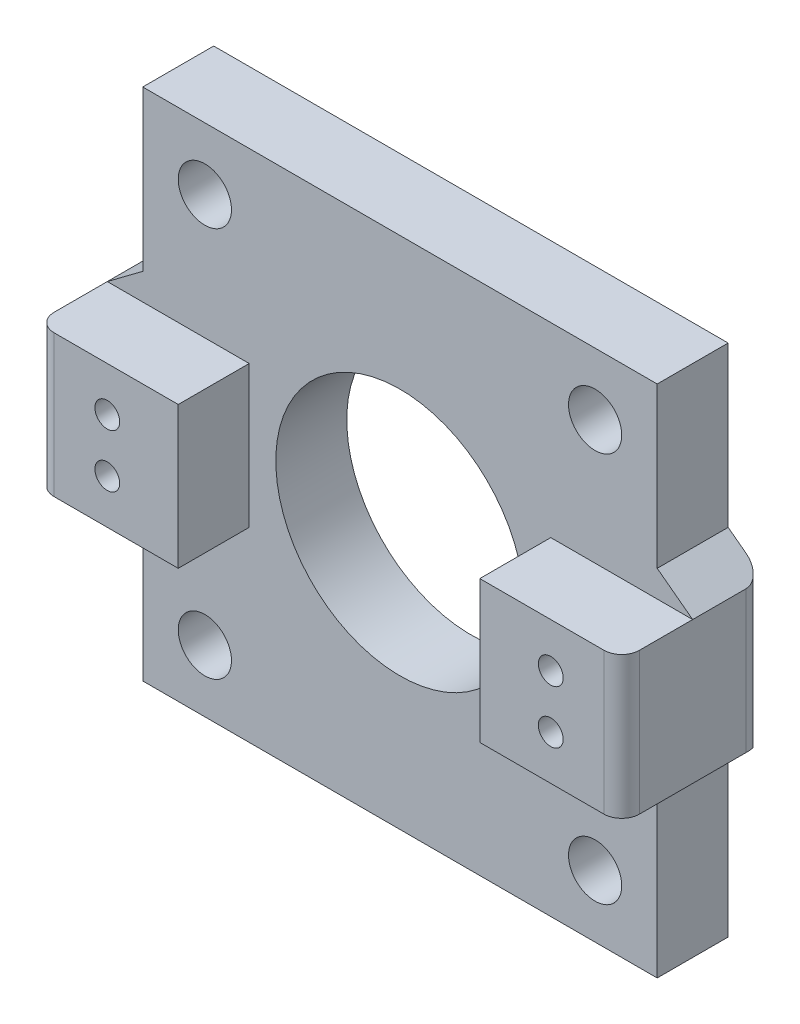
from build123d import *

# Parameters (mm, degrees)
SKETCH_1_W                  = 29
SKETCH_1_H                  = 29
SKETCH_1_R                  = 9.5
SKETCH_1_R_2                = 7
EXTRUDE_2_DEPTH             = 4
SKETCH_3_R                  = 1.5
CUT_EXTRUDE_1_DEPTH         = 5
SKETCH_4_W                  = 8
SKETCH_4_H                  = 8
SKETCH_4_R                  = 0.7
EXTRUDE_3_DEPTH             = 4
EXTRUDE_3_DIRECTION_2_REACH = 31.908
SKETCH_4_3_R                = 0.7
CUT_EXTRUDE_3_DEPTH         = 32.416135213
SKETCH_5_W                  = 2
SKETCH_5_H                  = 5
CUT_EXTRUDE_7_DEPTH         = 1.3
EXTRUDE_4_DEPTH             = 4
FILLET_2_R                  = 1
FILLET_2_OF_MIRROR_1_R      = 1


with BuildPart() as part:
    # Sketch 1 → Extrude 2 (new body)
    # profile 1 of 2: a face of its own
    with BuildSketch(Plane.XY):
        with Locations((-7.623161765, -5.224264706)):
            Rectangle(SKETCH_1_W, SKETCH_1_H)
        with Locations((-7.623161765, -5.224264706)):
            Circle(SKETCH_1_R, mode=Mode.SUBTRACT)
    # profile 2 of 2: a face of its own
    with BuildSketch(Plane.XY):
        with Locations((-7.623161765, -5.224264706)):
            Circle(SKETCH_1_R)
        with Locations((-7.623161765, -5.224264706)):
            Circle(SKETCH_1_R_2, mode=Mode.SUBTRACT)
    extrude(amount=EXTRUDE_2_DEPTH)

    # Sketch 3 → Cut-Extrude 1 (cut)
    with BuildSketch(Plane.XY.offset(4)):
        with Locations((-18.623161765, 5.775735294)):
            Circle(SKETCH_3_R)
        with Locations((3.376838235, 5.775735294)):
            Circle(SKETCH_3_R)
        with Locations((3.376838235, -16.224264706)):
            Circle(SKETCH_3_R)
        with Locations((-18.623161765, -16.224264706)):
            Circle(SKETCH_3_R)
    extrude(amount=-CUT_EXTRUDE_1_DEPTH, mode=Mode.SUBTRACT)

    # Sketch 4 → Extrude 3 (add)
    with BuildSketch(Plane.XY.offset(4)):
        with Locations((-20.123161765, -5.224264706)):
            Rectangle(SKETCH_4_W, SKETCH_4_H)
        with Locations((-20.123161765, -3.724264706)):
            Circle(SKETCH_4_R, mode=Mode.SUBTRACT)
        with Locations((-20.123161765, -6.724264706)):
            Circle(SKETCH_4_R, mode=Mode.SUBTRACT)
    extrude_3 = extrude(amount=EXTRUDE_3_DEPTH)

    # Extrude 3 direction 2: up to this face of the body (flat: up to its plane)
    extrude_3_direction_2_end = Plane(part.part.faces().sort_by_distance((6.466716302, -5.224264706, 0))[0])
    # Sketch 4 → Extrude 3 direction 2 (add, up to the picked face)
    with BuildSketch(Plane.XY.offset(4), mode=Mode.PRIVATE) as extrude_3_direction_2_sk1:
        with Locations((-20.123161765, -5.224264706)):
            Rectangle(SKETCH_4_W, SKETCH_4_H)
        with Locations((-20.123161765, -3.724264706)):
            Circle(SKETCH_4_R, mode=Mode.SUBTRACT)
        with Locations((-20.123161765, -6.724264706)):
            Circle(SKETCH_4_R, mode=Mode.SUBTRACT)
    extrude_3_direction_2_tool1 = split(extrude(extrude_3_direction_2_sk1.sketch, amount=-EXTRUDE_3_DIRECTION_2_REACH, mode=Mode.PRIVATE), bisect_by=extrude_3_direction_2_end, keep=Keep.BOTH, mode=Mode.PRIVATE)
    extrude_3_direction_2 = extrude_3_direction_2_tool1.solids().sort_by(Axis((-20.123162, -5.224265, 4), (0, 0, -1)))[0]
    add(extrude_3_direction_2)

    # Sketch 4_3 → Cut-Extrude 3 (cut, through all)
    with BuildSketch(Plane.XY.offset(4)):
        with Locations((-20.123161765, -3.724264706)):
            Circle(SKETCH_4_3_R)
        with Locations((-20.123161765, -6.724264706)):
            Circle(SKETCH_4_3_R)
    cut_extrude_3 = extrude(amount=-CUT_EXTRUDE_3_DEPTH, mode=Mode.SUBTRACT)

    # Sketch 5 → Cut-Extrude 7 (cut)
    with BuildSketch(Plane(origin=(0, 0, 0), x_dir=(-1, 0, 0), z_dir=(0, 0, -1))):
        with Locations((20.123161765, -2.024264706)):
            Rectangle(SKETCH_5_W, SKETCH_5_H)
        with Locations((20.123161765, -8.424264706)):
            Rectangle(SKETCH_5_W, SKETCH_5_H)
    cut_extrude_7 = extrude(amount=-CUT_EXTRUDE_7_DEPTH, mode=Mode.SUBTRACT)

    # Sketch 6 → Extrude 4 (add)
    with BuildSketch(Plane.XY.offset(4)):
        Polygon((-22.123161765, 0.275735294), (-24.123161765, -1.224264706), (-22.123161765, -1.224264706), align=None)
        Polygon((-22.123161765, -9.224264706), (-24.123161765, -9.224264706), (-22.123161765, -10.724264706), align=None)
    extrude_4 = extrude(amount=-EXTRUDE_4_DEPTH)

    # Fillet 2
    fillet_2_edges = [part.edges().sort_by_distance(p)[0] for p in [
        (-24.123161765, -5.224264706, 0),
        (-24.123161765, -5.224264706, 8),
    ]]
    fillet(fillet_2_edges, radius=FILLET_2_R)

    # Mirror 1: Extrude 3, Extrude 3 direction 2, Cut-Extrude 3, Cut-Extrude 7, Extrude 4 across plane
    add(extrude_3.mirror(Plane.ZY.offset(7.623161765)))
    add(extrude_3_direction_2.mirror(Plane.ZY.offset(7.623161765)))
    add(cut_extrude_3.mirror(Plane.ZY.offset(7.623161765)), mode=Mode.SUBTRACT)
    add(cut_extrude_7.mirror(Plane.ZY.offset(7.623161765)), mode=Mode.SUBTRACT)
    add(extrude_4.mirror(Plane.ZY.offset(7.623161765)))

    # Fillet 2 of Mirror 1
    fillet_2_of_mirror_1_edges = [part.edges().sort_by_distance(p)[0] for p in [
        (8.876838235, -5.224264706, 0),
        (8.876838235, -5.224264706, 8),
    ]]
    fillet(fillet_2_of_mirror_1_edges, radius=FILLET_2_OF_MIRROR_1_R)


solid = part.part
